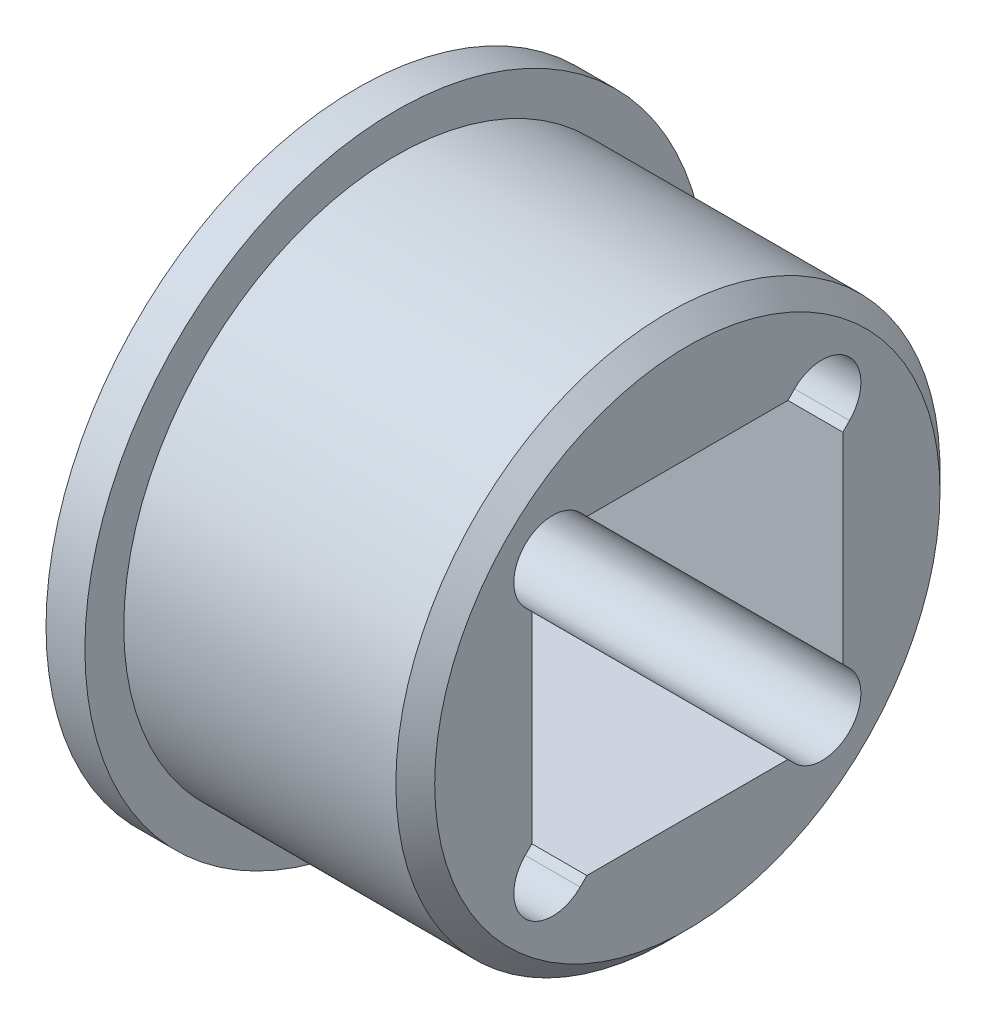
from build123d import *

# Parameters (mm, degrees)
ESQUISSE2_W             = 16
ESQUISSE2_H             = 16
ENL_V_MAT_EXTRU_1_DEPTH = 29.301943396
CHANFREIN1_SIZE         = 1
ENL_V_MAT_EXTRU_2_DEPTH = 29.301943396


with BuildPart() as part:
    # Esquisse1 → R_volution1 (revolve)
    with BuildSketch(Plane.XY, mode=Mode.PRIVATE) as r_volution1_sk:
        Polygon((0, 0), (17, 0), (17, 14), (2, 14), (2, 16), (0, 16), align=None)
    revolve(r_volution1_sk.sketch.rotate(Axis((-19.097215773, 0, 0), (1, 0, 0)), 90), axis=Axis((-19.097215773, 0, 0), (1, 0, 0)))

    # Esquisse2 → Enl_v. mat.-Extru.1 (cut, through all)
    with BuildSketch(Plane(origin=(17, 0, 0), x_dir=(0, 0, -1), z_dir=(1, 0, 0))):
        Rectangle(ESQUISSE2_W, ESQUISSE2_H)
    extrude(amount=-ENL_V_MAT_EXTRU_1_DEPTH, mode=Mode.SUBTRACT)

    # Chanfrein1
    chanfrein1_edges = [part.edges().sort_by_distance(p)[0] for p in [
        (17, 0, -14),
    ]]
    chamfer(chanfrein1_edges, length=CHANFREIN1_SIZE)

    # Esquisse3 → Enl_v. mat.-Extru.2 (cut, through all)
    with BuildSketch(Plane(origin=(17, 0, 0), x_dir=(0, 0, -1), z_dir=(1, 0, 0))):
        with BuildLine():
            Line((5.515432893, 8.343860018), (5.171572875, 8))
            Line((5.171572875, 8), (8, 5.171572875))
            Line((8, 5.171572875), (8.343860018, 5.515432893))
            ThreePointArc((8.343860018, 5.515432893), (8.343860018, 8.343860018), (5.515432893, 8.343860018))
        make_face()
        with BuildLine():
            Line((8.343860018, -5.515432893), (8, -5.171572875))
            Line((8, -5.171572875), (5.171572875, -8))
            Line((5.171572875, -8), (5.515432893, -8.343860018))
            ThreePointArc((5.515432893, -8.343860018), (8.343860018, -8.343860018), (8.343860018, -5.515432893))
        make_face()
        with BuildLine():
            Line((-5.515432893, -8.343860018), (-5.171572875, -8))
            Line((-5.171572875, -8), (-8, -5.171572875))
            Line((-8, -5.171572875), (-8.343860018, -5.515432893))
            ThreePointArc((-8.343860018, -5.515432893), (-8.343860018, -8.343860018), (-5.515432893, -8.343860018))
        make_face()
        with BuildLine():
            Line((-8.343860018, 5.515432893), (-8, 5.171572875))
            Line((-8, 5.171572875), (-5.171572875, 8))
            Line((-5.171572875, 8), (-5.515432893, 8.343860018))
            ThreePointArc((-5.515432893, 8.343860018), (-8.343860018, 8.343860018), (-8.343860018, 5.515432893))
        make_face()
    extrude(amount=-ENL_V_MAT_EXTRU_2_DEPTH, mode=Mode.SUBTRACT)


solid = part.part
